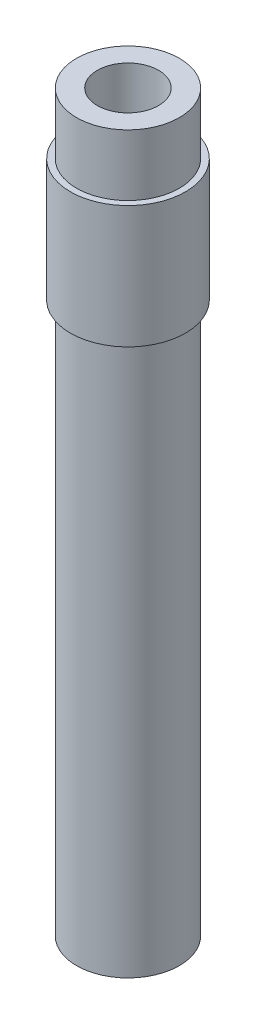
ISO-10303-21;
HEADER;
FILE_DESCRIPTION(('STEP AP214'),'2;1');
FILE_NAME('part.step','',(''),(''),'','','');
FILE_SCHEMA(('AUTOMOTIVE_DESIGN { 1 0 10303 214 1 1 1 1 }'));
ENDSEC;
DATA;
#1=APPLICATION_CONTEXT('core data for automotive mechanical design processes');
#2=APPLICATION_PROTOCOL_DEFINITION('international standard','automotive_design',2000,#1);
#3=PRODUCT_CONTEXT('',#1,'mechanical');
#4=PRODUCT('Part','Part','',(#3));
#5=PRODUCT_RELATED_PRODUCT_CATEGORY('part','',(#4));
#6=PRODUCT_DEFINITION_FORMATION('','',#4);
#7=PRODUCT_DEFINITION_CONTEXT('part definition',#1,'design');
#8=PRODUCT_DEFINITION('design','',#6,#7);
#9=PRODUCT_DEFINITION_SHAPE('','',#8);
#10=(LENGTH_UNIT() NAMED_UNIT(*) SI_UNIT(.MILLI.,.METRE.));
#11=(NAMED_UNIT(*) PLANE_ANGLE_UNIT() SI_UNIT($,.RADIAN.));
#12=(NAMED_UNIT(*) SI_UNIT($,.STERADIAN.) SOLID_ANGLE_UNIT());
#13=UNCERTAINTY_MEASURE_WITH_UNIT(LENGTH_MEASURE(1.E-05),#10,'distance_accuracy_value','');
#14=(GEOMETRIC_REPRESENTATION_CONTEXT(3) GLOBAL_UNCERTAINTY_ASSIGNED_CONTEXT((#13)) GLOBAL_UNIT_ASSIGNED_CONTEXT((#10,
#11,#12)) REPRESENTATION_CONTEXT('',''));
#15=CARTESIAN_POINT('',(0.,0.,0.));
#16=DIRECTION('',(0.,0.,1.));
#17=DIRECTION('',(1.,0.,0.));
#18=AXIS2_PLACEMENT_3D('',#15,#16,#17);
#19=CARTESIAN_POINT('',(0.,152.4,0.));
#20=DIRECTION('',(0.,-1.,0.));
#21=DIRECTION('',(0.,0.,-1.));
#22=AXIS2_PLACEMENT_3D('',#19,#20,#21);
#23=CYLINDRICAL_SURFACE('',#22,10.668);
#24=CARTESIAN_POINT('',(0.,114.3,0.));
#25=DIRECTION('',(0.,1.,0.));
#26=DIRECTION('',(0.,0.,1.));
#27=AXIS2_PLACEMENT_3D('',#24,#25,#26);
#28=CIRCLE('',#27,10.668);
#29=CARTESIAN_POINT('',(0.,114.3,-10.668));
#30=VERTEX_POINT('',#29);
#31=EDGE_CURVE('E75',#30,#30,#28,.T.);
#32=CARTESIAN_POINT('',(0.,0.,0.));
#33=DIRECTION('',(0.,1.,0.));
#34=DIRECTION('',(0.,0.,1.));
#35=AXIS2_PLACEMENT_3D('',#32,#33,#34);
#36=CIRCLE('',#35,10.668);
#37=CARTESIAN_POINT('',(0.,0.,-10.668));
#38=VERTEX_POINT('',#37);
#39=EDGE_CURVE('E45',#38,#38,#36,.T.);
#40=CARTESIAN_POINT('',(0.,114.3,-10.668));
#41=CARTESIAN_POINT('',(0.,113.109375,-10.668));
#42=CARTESIAN_POINT('',(0.,111.91875,-10.668));
#43=CARTESIAN_POINT('',(0.,109.5375,-10.668));
#44=CARTESIAN_POINT('',(0.,108.346875,-10.668));
#45=CARTESIAN_POINT('',(0.,105.965625,-10.668));
#46=CARTESIAN_POINT('',(0.,104.775,-10.668));
#47=CARTESIAN_POINT('',(0.,102.39375,-10.668));
#48=CARTESIAN_POINT('',(0.,101.203125,-10.668));
#49=CARTESIAN_POINT('',(0.,98.821875,-10.668));
#50=CARTESIAN_POINT('',(0.,97.63125,-10.668));
#51=CARTESIAN_POINT('',(0.,95.25,-10.668));
#52=CARTESIAN_POINT('',(0.,94.059375,-10.668));
#53=CARTESIAN_POINT('',(0.,91.678125,-10.668));
#54=CARTESIAN_POINT('',(0.,90.4875,-10.668));
#55=CARTESIAN_POINT('',(0.,88.10625,-10.668));
#56=CARTESIAN_POINT('',(0.,86.915625,-10.668));
#57=CARTESIAN_POINT('',(0.,84.534375,-10.668));
#58=CARTESIAN_POINT('',(0.,83.34375,-10.668));
#59=CARTESIAN_POINT('',(0.,80.9625,-10.668));
#60=CARTESIAN_POINT('',(0.,79.771875,-10.668));
#61=CARTESIAN_POINT('',(0.,77.390625,-10.668));
#62=CARTESIAN_POINT('',(0.,76.2,-10.668));
#63=CARTESIAN_POINT('',(0.,73.81875,-10.668));
#64=CARTESIAN_POINT('',(0.,72.628125,-10.668));
#65=CARTESIAN_POINT('',(0.,70.246875,-10.668));
#66=CARTESIAN_POINT('',(0.,69.05625,-10.668));
#67=CARTESIAN_POINT('',(0.,66.675,-10.668));
#68=CARTESIAN_POINT('',(0.,65.484375,-10.668));
#69=CARTESIAN_POINT('',(0.,63.103125,-10.668));
#70=CARTESIAN_POINT('',(0.,61.9125,-10.668));
#71=CARTESIAN_POINT('',(0.,59.53125,-10.668));
#72=CARTESIAN_POINT('',(0.,58.340625,-10.668));
#73=CARTESIAN_POINT('',(0.,55.959375,-10.668));
#74=CARTESIAN_POINT('',(0.,54.76875,-10.668));
#75=CARTESIAN_POINT('',(0.,52.3875,-10.668));
#76=CARTESIAN_POINT('',(0.,51.196875,-10.668));
#77=CARTESIAN_POINT('',(0.,48.815625,-10.668));
#78=CARTESIAN_POINT('',(0.,47.625,-10.668));
#79=CARTESIAN_POINT('',(0.,45.24375,-10.668));
#80=CARTESIAN_POINT('',(0.,44.053125,-10.668));
#81=CARTESIAN_POINT('',(0.,41.671875,-10.668));
#82=CARTESIAN_POINT('',(0.,40.48125,-10.668));
#83=CARTESIAN_POINT('',(0.,38.1,-10.668));
#84=CARTESIAN_POINT('',(0.,36.909375,-10.668));
#85=CARTESIAN_POINT('',(0.,34.528125,-10.668));
#86=CARTESIAN_POINT('',(0.,33.3375,-10.668));
#87=CARTESIAN_POINT('',(0.,30.95625,-10.668));
#88=CARTESIAN_POINT('',(0.,29.765625,-10.668));
#89=CARTESIAN_POINT('',(0.,27.384375,-10.668));
#90=CARTESIAN_POINT('',(0.,26.19375,-10.668));
#91=CARTESIAN_POINT('',(0.,23.8125,-10.668));
#92=CARTESIAN_POINT('',(0.,22.621875,-10.668));
#93=CARTESIAN_POINT('',(0.,20.240625,-10.668));
#94=CARTESIAN_POINT('',(0.,19.05,-10.668));
#95=CARTESIAN_POINT('',(0.,16.66875,-10.668));
#96=CARTESIAN_POINT('',(0.,15.478125,-10.668));
#97=CARTESIAN_POINT('',(0.,13.096875,-10.668));
#98=CARTESIAN_POINT('',(0.,11.90625,-10.668));
#99=CARTESIAN_POINT('',(0.,9.52500000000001,-10.668));
#100=CARTESIAN_POINT('',(0.,8.334375,-10.668));
#101=CARTESIAN_POINT('',(0.,5.953125,-10.668));
#102=CARTESIAN_POINT('',(0.,4.7625,-10.668));
#103=CARTESIAN_POINT('',(0.,2.38125,-10.668));
#104=CARTESIAN_POINT('',(0.,1.190625,-10.668));
#105=CARTESIAN_POINT('',(0.,0.,-10.668));
#106=B_SPLINE_CURVE_WITH_KNOTS('',3,(#40,#41,#42,#43,#44,#45,#46,#47,#48,#49,#50,#51,#52,#53,
#54,#55,#56,#57,#58,#59,#60,#61,#62,#63,#64,#65,#66,#67,#68,#69,#70,#71,#72,#73,#74,#75,#76,#77,
#78,#79,#80,#81,#82,#83,#84,#85,#86,#87,#88,#89,#90,#91,#92,#93,#94,#95,#96,#97,#98,#99,#100,
#101,#102,#103,#104,#105),.UNSPECIFIED.,.F.,.F.,(4,2,2,2,2,2,2,2,2,2,2,2,2,2,2,2,2,2,2,2,2,2,2,
2,2,2,2,2,2,2,2,2,4),(0.,3.571875,7.14375,10.715625,14.2875,17.859375,21.43125,25.003125,28.575,
32.146875,35.71875,39.290625,42.8625,46.434375,50.00625,53.578125,57.15,60.721875,64.29375,
67.865625,71.4375,75.009375,78.58125,82.153125,85.725,89.296875,92.86875,96.440625,100.0125,
103.584375,107.15625,110.728125,114.3),.UNSPECIFIED.);
#107=EDGE_CURVE('BSEAM41',#30,#38,#106,.T.);
#108=ORIENTED_EDGE('',*,*,#31,.F.);
#109=ORIENTED_EDGE('',*,*,#39,.T.);
#110=ORIENTED_EDGE('',*,*,#107,.T.);
#111=ORIENTED_EDGE('',*,*,#107,.F.);
#112=EDGE_LOOP('',(#108,#110,#109,#111));
#113=FACE_BOUND('',#112,.T.);
#114=ADVANCED_FACE('F41',(#113),#23,.T.);
#115=CARTESIAN_POINT('',(0.,152.4,0.));
#116=DIRECTION('',(0.,1.,0.));
#117=DIRECTION('',(0.,0.,1.));
#118=AXIS2_PLACEMENT_3D('',#115,#116,#117);
#119=PLANE('',#118);
#120=CARTESIAN_POINT('',(0.,152.4,0.));
#121=DIRECTION('',(0.,1.,0.));
#122=DIRECTION('',(0.,0.,1.));
#123=AXIS2_PLACEMENT_3D('',#120,#121,#122);
#124=CIRCLE('',#123,10.668);
#125=CARTESIAN_POINT('',(0.,152.4,-10.668));
#126=VERTEX_POINT('',#125);
#127=EDGE_CURVE('E10',#126,#126,#124,.T.);
#128=ORIENTED_EDGE('',*,*,#127,.T.);
#129=EDGE_LOOP('',(#128));
#130=FACE_BOUND('',#129,.T.);
#131=CARTESIAN_POINT('',(0.,152.4,0.));
#132=DIRECTION('',(0.,1.,0.));
#133=DIRECTION('',(0.,0.,1.));
#134=AXIS2_PLACEMENT_3D('',#131,#132,#133);
#135=CIRCLE('',#134,6.35);
#136=CARTESIAN_POINT('',(0.,152.4,-6.35));
#137=VERTEX_POINT('',#136);
#138=EDGE_CURVE('E54',#137,#137,#135,.T.);
#139=ORIENTED_EDGE('',*,*,#138,.F.);
#140=EDGE_LOOP('',(#139));
#141=FACE_BOUND('',#140,.T.);
#142=ADVANCED_FACE('F85',(#130,#141),#119,.T.);
#143=CARTESIAN_POINT('',(0.,0.,0.));
#144=DIRECTION('',(0.,1.,0.));
#145=DIRECTION('',(0.,0.,1.));
#146=AXIS2_PLACEMENT_3D('',#143,#144,#145);
#147=PLANE('',#146);
#148=ORIENTED_EDGE('',*,*,#39,.F.);
#149=EDGE_LOOP('',(#148));
#150=FACE_BOUND('',#149,.T.);
#151=CARTESIAN_POINT('',(0.,0.,0.));
#152=DIRECTION('',(0.,1.,0.));
#153=DIRECTION('',(0.,0.,1.));
#154=AXIS2_PLACEMENT_3D('',#151,#152,#153);
#155=CIRCLE('',#154,6.35);
#156=CARTESIAN_POINT('',(0.,0.,-6.35));
#157=VERTEX_POINT('',#156);
#158=EDGE_CURVE('E56',#157,#157,#155,.T.);
#159=ORIENTED_EDGE('',*,*,#158,.T.);
#160=EDGE_LOOP('',(#159));
#161=FACE_BOUND('',#160,.T.);
#162=ADVANCED_FACE('F88',(#150,#161),#147,.F.);
#163=CARTESIAN_POINT('',(0.,139.7,0.));
#164=DIRECTION('',(0.,1.,0.));
#165=DIRECTION('',(0.,0.,1.));
#166=AXIS2_PLACEMENT_3D('',#163,#164,#165);
#167=CIRCLE('',#166,10.668);
#168=CARTESIAN_POINT('',(0.,139.7,-10.668));
#169=VERTEX_POINT('',#168);
#170=EDGE_CURVE('E71',#169,#169,#167,.T.);
#171=CARTESIAN_POINT('',(0.,139.7,-10.668));
#172=CARTESIAN_POINT('',(0.,139.832291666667,-10.668));
#173=CARTESIAN_POINT('',(0.,139.964583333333,-10.668));
#174=CARTESIAN_POINT('',(0.,140.229166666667,-10.668));
#175=CARTESIAN_POINT('',(0.,140.361458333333,-10.668));
#176=CARTESIAN_POINT('',(0.,140.626041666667,-10.668));
#177=CARTESIAN_POINT('',(0.,140.758333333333,-10.668));
#178=CARTESIAN_POINT('',(0.,141.022916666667,-10.668));
#179=CARTESIAN_POINT('',(0.,141.155208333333,-10.668));
#180=CARTESIAN_POINT('',(0.,141.419791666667,-10.668));
#181=CARTESIAN_POINT('',(0.,141.552083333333,-10.668));
#182=CARTESIAN_POINT('',(0.,141.816666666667,-10.668));
#183=CARTESIAN_POINT('',(0.,141.948958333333,-10.668));
#184=CARTESIAN_POINT('',(0.,142.213541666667,-10.668));
#185=CARTESIAN_POINT('',(0.,142.345833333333,-10.668));
#186=CARTESIAN_POINT('',(0.,142.610416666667,-10.668));
#187=CARTESIAN_POINT('',(0.,142.742708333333,-10.668));
#188=CARTESIAN_POINT('',(0.,143.007291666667,-10.668));
#189=CARTESIAN_POINT('',(0.,143.139583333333,-10.668));
#190=CARTESIAN_POINT('',(0.,143.404166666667,-10.668));
#191=CARTESIAN_POINT('',(0.,143.536458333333,-10.668));
#192=CARTESIAN_POINT('',(0.,143.801041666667,-10.668));
#193=CARTESIAN_POINT('',(0.,143.933333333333,-10.668));
#194=CARTESIAN_POINT('',(0.,144.197916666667,-10.668));
#195=CARTESIAN_POINT('',(0.,144.330208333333,-10.668));
#196=CARTESIAN_POINT('',(0.,144.594791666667,-10.668));
#197=CARTESIAN_POINT('',(0.,144.727083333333,-10.668));
#198=CARTESIAN_POINT('',(0.,144.991666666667,-10.668));
#199=CARTESIAN_POINT('',(0.,145.123958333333,-10.668));
#200=CARTESIAN_POINT('',(0.,145.388541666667,-10.668));
#201=CARTESIAN_POINT('',(0.,145.520833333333,-10.668));
#202=CARTESIAN_POINT('',(0.,145.785416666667,-10.668));
#203=CARTESIAN_POINT('',(0.,145.917708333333,-10.668));
#204=CARTESIAN_POINT('',(0.,146.182291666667,-10.668));
#205=CARTESIAN_POINT('',(0.,146.314583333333,-10.668));
#206=CARTESIAN_POINT('',(0.,146.579166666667,-10.668));
#207=CARTESIAN_POINT('',(0.,146.711458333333,-10.668));
#208=CARTESIAN_POINT('',(0.,146.976041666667,-10.668));
#209=CARTESIAN_POINT('',(0.,147.108333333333,-10.668));
#210=CARTESIAN_POINT('',(0.,147.372916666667,-10.668));
#211=CARTESIAN_POINT('',(0.,147.505208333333,-10.668));
#212=CARTESIAN_POINT('',(0.,147.769791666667,-10.668));
#213=CARTESIAN_POINT('',(0.,147.902083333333,-10.668));
#214=CARTESIAN_POINT('',(0.,148.166666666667,-10.668));
#215=CARTESIAN_POINT('',(0.,148.298958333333,-10.668));
#216=CARTESIAN_POINT('',(0.,148.563541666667,-10.668));
#217=CARTESIAN_POINT('',(0.,148.695833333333,-10.668));
#218=CARTESIAN_POINT('',(0.,148.960416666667,-10.668));
#219=CARTESIAN_POINT('',(0.,149.092708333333,-10.668));
#220=CARTESIAN_POINT('',(0.,149.357291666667,-10.668));
#221=CARTESIAN_POINT('',(0.,149.489583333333,-10.668));
#222=CARTESIAN_POINT('',(0.,149.754166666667,-10.668));
#223=CARTESIAN_POINT('',(0.,149.886458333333,-10.668));
#224=CARTESIAN_POINT('',(0.,150.151041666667,-10.668));
#225=CARTESIAN_POINT('',(0.,150.283333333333,-10.668));
#226=CARTESIAN_POINT('',(0.,150.547916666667,-10.668));
#227=CARTESIAN_POINT('',(0.,150.680208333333,-10.668));
#228=CARTESIAN_POINT('',(0.,150.944791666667,-10.668));
#229=CARTESIAN_POINT('',(0.,151.077083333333,-10.668));
#230=CARTESIAN_POINT('',(0.,151.341666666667,-10.668));
#231=CARTESIAN_POINT('',(0.,151.473958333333,-10.668));
#232=CARTESIAN_POINT('',(0.,151.738541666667,-10.668));
#233=CARTESIAN_POINT('',(0.,151.870833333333,-10.668));
#234=CARTESIAN_POINT('',(0.,152.135416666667,-10.668));
#235=CARTESIAN_POINT('',(0.,152.267708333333,-10.668));
#236=CARTESIAN_POINT('',(0.,152.4,-10.668));
#237=B_SPLINE_CURVE_WITH_KNOTS('',3,(#171,#172,#173,#174,#175,#176,#177,#178,#179,#180,#181,
#182,#183,#184,#185,#186,#187,#188,#189,#190,#191,#192,#193,#194,#195,#196,#197,#198,#199,#200,
#201,#202,#203,#204,#205,#206,#207,#208,#209,#210,#211,#212,#213,#214,#215,#216,#217,#218,#219,
#220,#221,#222,#223,#224,#225,#226,#227,#228,#229,#230,#231,#232,#233,#234,#235,#236),
.UNSPECIFIED.,.F.,.F.,(4,2,2,2,2,2,2,2,2,2,2,2,2,2,2,2,2,2,2,2,2,2,2,2,2,2,2,2,2,2,2,2,4),(0.,
0.396874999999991,0.793749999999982,1.19062499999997,1.58749999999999,1.98437499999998,
2.38124999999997,2.77812499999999,3.17499999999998,3.57187499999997,3.96874999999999,
4.36562499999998,4.76249999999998,5.15937499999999,5.55624999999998,5.95312499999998,
6.34999999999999,6.74687499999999,7.14374999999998,7.54062499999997,7.93749999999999,
8.33437499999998,8.73124999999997,9.12812499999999,9.52499999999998,9.92187499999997,10.31875,
10.715625,11.1125,11.509375,11.90625,12.303125,12.7),.UNSPECIFIED.);
#238=EDGE_CURVE('BSEAM43',#169,#126,#237,.T.);
#239=ORIENTED_EDGE('',*,*,#170,.T.);
#240=ORIENTED_EDGE('',*,*,#127,.F.);
#241=ORIENTED_EDGE('',*,*,#238,.T.);
#242=ORIENTED_EDGE('',*,*,#238,.F.);
#243=EDGE_LOOP('',(#239,#241,#240,#242));
#244=FACE_BOUND('',#243,.T.);
#245=ADVANCED_FACE('F43',(#244),#23,.T.);
#246=CARTESIAN_POINT('',(0.,152.4,0.));
#247=DIRECTION('',(0.,-1.,0.));
#248=DIRECTION('',(0.,0.,-1.));
#249=AXIS2_PLACEMENT_3D('',#246,#247,#248);
#250=CYLINDRICAL_SURFACE('',#249,6.35);
#251=CARTESIAN_POINT('',(0.,152.4,-6.35));
#252=CARTESIAN_POINT('',(0.,150.8125,-6.35));
#253=CARTESIAN_POINT('',(0.,149.225,-6.35));
#254=CARTESIAN_POINT('',(0.,146.05,-6.35));
#255=CARTESIAN_POINT('',(0.,144.4625,-6.35));
#256=CARTESIAN_POINT('',(0.,141.2875,-6.35));
#257=CARTESIAN_POINT('',(0.,139.7,-6.35));
#258=CARTESIAN_POINT('',(0.,136.525,-6.35));
#259=CARTESIAN_POINT('',(0.,134.9375,-6.35));
#260=CARTESIAN_POINT('',(0.,131.7625,-6.35));
#261=CARTESIAN_POINT('',(0.,130.175,-6.35));
#262=CARTESIAN_POINT('',(0.,127.,-6.35));
#263=CARTESIAN_POINT('',(0.,125.4125,-6.35));
#264=CARTESIAN_POINT('',(0.,122.2375,-6.35));
#265=CARTESIAN_POINT('',(0.,120.65,-6.35));
#266=CARTESIAN_POINT('',(0.,117.475,-6.35));
#267=CARTESIAN_POINT('',(0.,115.8875,-6.35));
#268=CARTESIAN_POINT('',(0.,112.7125,-6.35));
#269=CARTESIAN_POINT('',(0.,111.125,-6.35));
#270=CARTESIAN_POINT('',(0.,107.95,-6.35));
#271=CARTESIAN_POINT('',(0.,106.3625,-6.35));
#272=CARTESIAN_POINT('',(0.,103.1875,-6.35));
#273=CARTESIAN_POINT('',(0.,101.6,-6.35));
#274=CARTESIAN_POINT('',(0.,98.425,-6.35));
#275=CARTESIAN_POINT('',(0.,96.8375,-6.35));
#276=CARTESIAN_POINT('',(0.,93.6625,-6.35));
#277=CARTESIAN_POINT('',(0.,92.075,-6.35));
#278=CARTESIAN_POINT('',(0.,88.9,-6.35));
#279=CARTESIAN_POINT('',(0.,87.3125,-6.35));
#280=CARTESIAN_POINT('',(0.,84.1375,-6.35));
#281=CARTESIAN_POINT('',(0.,82.55,-6.35));
#282=CARTESIAN_POINT('',(0.,79.375,-6.35));
#283=CARTESIAN_POINT('',(0.,77.7875,-6.35));
#284=CARTESIAN_POINT('',(0.,74.6125,-6.35));
#285=CARTESIAN_POINT('',(0.,73.025,-6.35));
#286=CARTESIAN_POINT('',(0.,69.85,-6.35));
#287=CARTESIAN_POINT('',(0.,68.2625,-6.35));
#288=CARTESIAN_POINT('',(0.,65.0875,-6.35));
#289=CARTESIAN_POINT('',(0.,63.5,-6.35));
#290=CARTESIAN_POINT('',(0.,60.325,-6.35));
#291=CARTESIAN_POINT('',(0.,58.7375,-6.35));
#292=CARTESIAN_POINT('',(0.,55.5625,-6.35));
#293=CARTESIAN_POINT('',(0.,53.975,-6.35));
#294=CARTESIAN_POINT('',(0.,50.8,-6.35));
#295=CARTESIAN_POINT('',(0.,49.2125,-6.35));
#296=CARTESIAN_POINT('',(0.,46.0375,-6.35));
#297=CARTESIAN_POINT('',(0.,44.45,-6.35));
#298=CARTESIAN_POINT('',(0.,41.275,-6.35));
#299=CARTESIAN_POINT('',(0.,39.6875,-6.35));
#300=CARTESIAN_POINT('',(0.,36.5125,-6.35));
#301=CARTESIAN_POINT('',(0.,34.925,-6.35));
#302=CARTESIAN_POINT('',(0.,31.75,-6.35));
#303=CARTESIAN_POINT('',(0.,30.1625,-6.35));
#304=CARTESIAN_POINT('',(0.,26.9875,-6.35));
#305=CARTESIAN_POINT('',(0.,25.4,-6.35));
#306=CARTESIAN_POINT('',(0.,22.225,-6.35));
#307=CARTESIAN_POINT('',(0.,20.6375,-6.35));
#308=CARTESIAN_POINT('',(0.,17.4625,-6.35));
#309=CARTESIAN_POINT('',(0.,15.875,-6.35));
#310=CARTESIAN_POINT('',(0.,12.7,-6.35));
#311=CARTESIAN_POINT('',(0.,11.1125,-6.35));
#312=CARTESIAN_POINT('',(0.,7.93750000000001,-6.35));
#313=CARTESIAN_POINT('',(0.,6.35,-6.35));
#314=CARTESIAN_POINT('',(0.,3.175,-6.35));
#315=CARTESIAN_POINT('',(0.,1.5875,-6.35));
#316=CARTESIAN_POINT('',(0.,0.,-6.35));
#317=B_SPLINE_CURVE_WITH_KNOTS('',3,(#251,#252,#253,#254,#255,#256,#257,#258,#259,#260,#261,
#262,#263,#264,#265,#266,#267,#268,#269,#270,#271,#272,#273,#274,#275,#276,#277,#278,#279,#280,
#281,#282,#283,#284,#285,#286,#287,#288,#289,#290,#291,#292,#293,#294,#295,#296,#297,#298,#299,
#300,#301,#302,#303,#304,#305,#306,#307,#308,#309,#310,#311,#312,#313,#314,#315,#316),
.UNSPECIFIED.,.F.,.F.,(4,2,2,2,2,2,2,2,2,2,2,2,2,2,2,2,2,2,2,2,2,2,2,2,2,2,2,2,2,2,2,2,4),(0.,
4.7625,9.52500000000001,14.2875,19.05,23.8125,28.575,33.3375,38.1,42.8625,47.625,52.3875,57.15,
61.9125,66.675,71.4375,76.2,80.9625,85.725,90.4875,95.25,100.0125,104.775,109.5375,114.3,
119.0625,123.825,128.5875,133.35,138.1125,142.875,147.6375,152.4),.UNSPECIFIED.);
#318=EDGE_CURVE('BSEAM93',#137,#157,#317,.T.);
#319=ORIENTED_EDGE('',*,*,#138,.T.);
#320=ORIENTED_EDGE('',*,*,#158,.F.);
#321=ORIENTED_EDGE('',*,*,#318,.T.);
#322=ORIENTED_EDGE('',*,*,#318,.F.);
#323=EDGE_LOOP('',(#319,#321,#320,#322));
#324=FACE_BOUND('',#323,.T.);
#325=ADVANCED_FACE('F93',(#324),#250,.F.);
#326=CARTESIAN_POINT('',(0.,114.3,0.));
#327=DIRECTION('',(0.,-1.,0.));
#328=DIRECTION('',(0.,0.,-1.));
#329=AXIS2_PLACEMENT_3D('',#326,#327,#328);
#330=PLANE('',#329);
#331=ORIENTED_EDGE('',*,*,#31,.T.);
#332=EDGE_LOOP('',(#331));
#333=FACE_BOUND('',#332,.T.);
#334=CARTESIAN_POINT('',(0.,114.3,0.));
#335=DIRECTION('',(0.,1.,0.));
#336=DIRECTION('',(0.,0.,1.));
#337=AXIS2_PLACEMENT_3D('',#334,#335,#336);
#338=CIRCLE('',#337,11.938);
#339=CARTESIAN_POINT('',(0.,114.3,11.938));
#340=VERTEX_POINT('',#339);
#341=EDGE_CURVE('E60',#340,#340,#338,.T.);
#342=ORIENTED_EDGE('',*,*,#341,.F.);
#343=EDGE_LOOP('',(#342));
#344=FACE_BOUND('',#343,.T.);
#345=ADVANCED_FACE('F80',(#333,#344),#330,.T.);
#346=CARTESIAN_POINT('',(0.,152.4,0.));
#347=DIRECTION('',(0.,1.,0.));
#348=DIRECTION('',(0.,0.,1.));
#349=AXIS2_PLACEMENT_3D('',#346,#347,#348);
#350=CYLINDRICAL_SURFACE('',#349,11.938);
#351=ORIENTED_EDGE('',*,*,#341,.T.);
#352=EDGE_LOOP('',(#351));
#353=FACE_BOUND('',#352,.T.);
#354=CARTESIAN_POINT('',(0.,139.7,0.));
#355=DIRECTION('',(0.,1.,0.));
#356=DIRECTION('',(0.,0.,1.));
#357=AXIS2_PLACEMENT_3D('',#354,#355,#356);
#358=CIRCLE('',#357,11.938);
#359=CARTESIAN_POINT('',(0.,139.7,11.938));
#360=VERTEX_POINT('',#359);
#361=EDGE_CURVE('E67',#360,#360,#358,.T.);
#362=ORIENTED_EDGE('',*,*,#361,.F.);
#363=EDGE_LOOP('',(#362));
#364=FACE_BOUND('',#363,.T.);
#365=ADVANCED_FACE('F101',(#353,#364),#350,.T.);
#366=CARTESIAN_POINT('',(0.,139.7,0.));
#367=DIRECTION('',(0.,1.,0.));
#368=DIRECTION('',(0.,0.,1.));
#369=AXIS2_PLACEMENT_3D('',#366,#367,#368);
#370=PLANE('',#369);
#371=ORIENTED_EDGE('',*,*,#361,.T.);
#372=EDGE_LOOP('',(#371));
#373=FACE_BOUND('',#372,.T.);
#374=ORIENTED_EDGE('',*,*,#170,.F.);
#375=EDGE_LOOP('',(#374));
#376=FACE_BOUND('',#375,.T.);
#377=ADVANCED_FACE('F142',(#373,#376),#370,.T.);
#378=CLOSED_SHELL('',(#114,#142,#162,#245,#325,#345,#365,#377));
#379=MANIFOLD_SOLID_BREP('B2',#378);
#380=ADVANCED_BREP_SHAPE_REPRESENTATION('',(#18,#379),#14);
#381=SHAPE_DEFINITION_REPRESENTATION(#9,#380);
ENDSEC;
END-ISO-10303-21;
